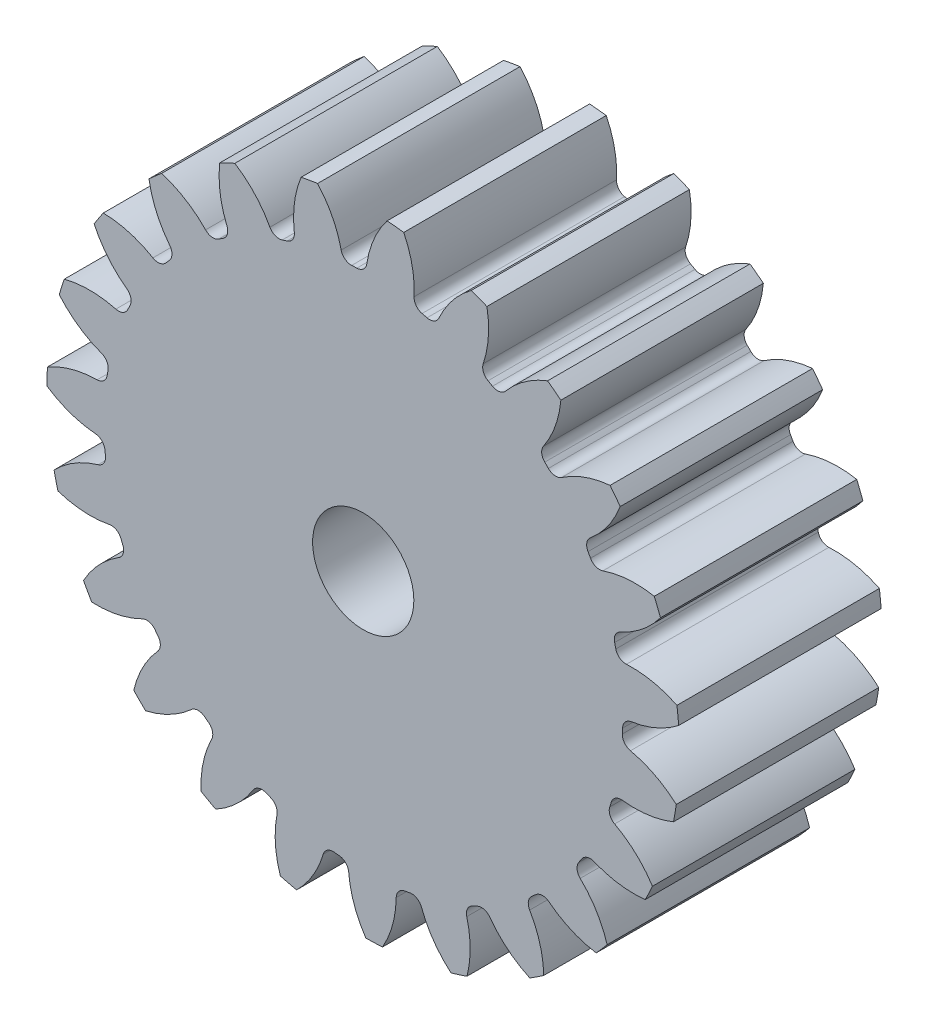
from build123d import *

# Parameters (mm, degrees)
SKETCH3_R         = 158.75
GEARBODY_DEPTH    = 101.6
TOOTHCUT_DEPTH    = 247.425820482
CIRPATTERN1_COUNT = 23
BOREDIA_R         = 25.4
BORE_DEPTH        = 12700


with BuildPart() as part:
    # Sketch3 → gearBody (new body)
    with BuildSketch(Plane.XY):
        Circle(SKETCH3_R)
    extrude(amount=GEARBODY_DEPTH)

    # Sketch2 → toothCut (cut, through all)
    with BuildSketch(Plane.XY):
        with BuildLine():
            ThreePointArc((130.050949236, -5.681657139), (130.100810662, -4.394279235), (130.137928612, -3.106470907))
            ThreePointArc((130.137928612, -3.106470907), (131.424777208, 0.184653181), (134.525365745, 1.879889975))
            ThreePointArc((134.525365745, 1.879889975), (147.333536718, 5.590751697), (158.75, 12.481622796))
            ThreePointArc((158.75, 12.481622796), (159.149170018, -5.375415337), (157.546007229, -23.164822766))
            ThreePointArc((157.546007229, -23.164822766), (146.620523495, -15.519331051), (134.091932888, -10.952695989))
            ThreePointArc((134.091932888, -10.952695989), (131.112796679, -9.05211068), (130.050949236, -5.681657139))
        make_face()
    toothcut = extrude(amount=TOOTHCUT_DEPTH, mode=Mode.SUBTRACT)

    # CirPattern1: toothCut ×23 about axis
    cirpattern1_axis = Axis((0, 0, 0), (0, 0, 1))
    for i in range(1, CIRPATTERN1_COUNT):
        add(toothcut.rotate(cirpattern1_axis, i * 360 / CIRPATTERN1_COUNT), mode=Mode.SUBTRACT)

    # boreDia → bore (cut, symmetric)
    with BuildSketch(Plane.XY):
        Circle(BOREDIA_R)
    extrude(amount=BORE_DEPTH, both=True, mode=Mode.SUBTRACT)


solid = part.part
